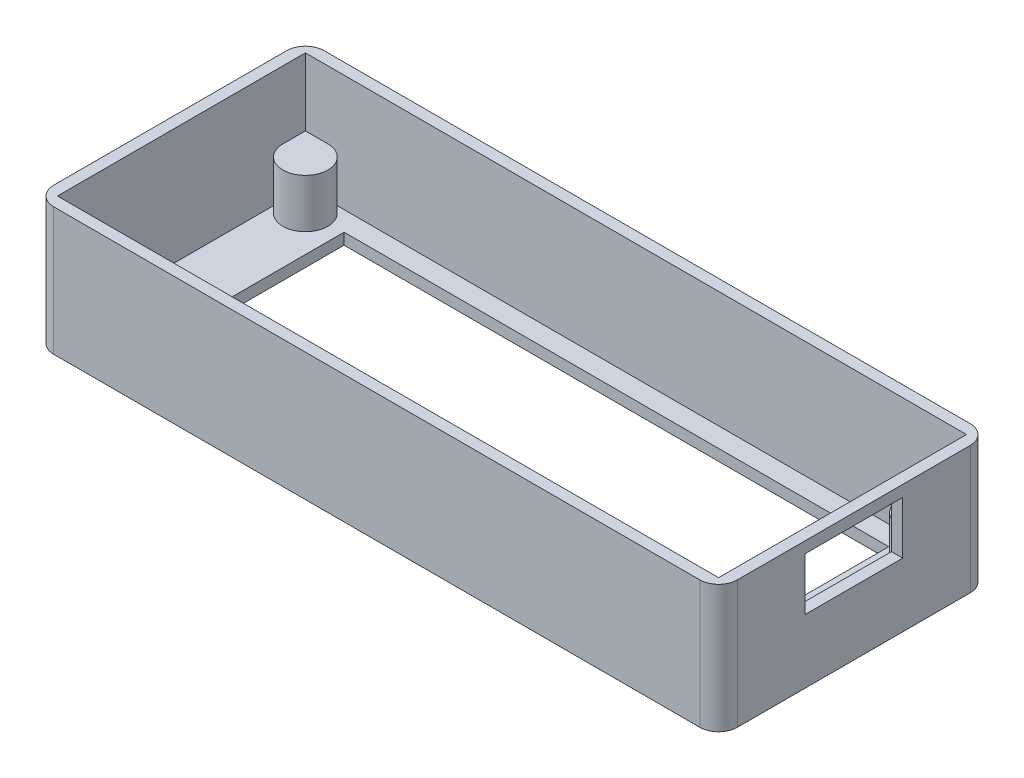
ISO-10303-21;
HEADER;
FILE_DESCRIPTION(('STEP AP214'),'2;1');
FILE_NAME('part.step','',(''),(''),'','','');
FILE_SCHEMA(('AUTOMOTIVE_DESIGN { 1 0 10303 214 1 1 1 1 }'));
ENDSEC;
DATA;
#1=APPLICATION_CONTEXT('core data for automotive mechanical design processes');
#2=APPLICATION_PROTOCOL_DEFINITION('international standard','automotive_design',2000,#1);
#3=PRODUCT_CONTEXT('',#1,'mechanical');
#4=PRODUCT('Part','Part','',(#3));
#5=PRODUCT_RELATED_PRODUCT_CATEGORY('part','',(#4));
#6=PRODUCT_DEFINITION_FORMATION('','',#4);
#7=PRODUCT_DEFINITION_CONTEXT('part definition',#1,'design');
#8=PRODUCT_DEFINITION('design','',#6,#7);
#9=PRODUCT_DEFINITION_SHAPE('','',#8);
#10=(LENGTH_UNIT() NAMED_UNIT(*) SI_UNIT(.MILLI.,.METRE.));
#11=(NAMED_UNIT(*) PLANE_ANGLE_UNIT() SI_UNIT($,.RADIAN.));
#12=(NAMED_UNIT(*) SI_UNIT($,.STERADIAN.) SOLID_ANGLE_UNIT());
#13=UNCERTAINTY_MEASURE_WITH_UNIT(LENGTH_MEASURE(1.E-05),#10,'distance_accuracy_value','');
#14=(GEOMETRIC_REPRESENTATION_CONTEXT(3) GLOBAL_UNCERTAINTY_ASSIGNED_CONTEXT((#13)) GLOBAL_UNIT_ASSIGNED_CONTEXT((#10,
#11,#12)) REPRESENTATION_CONTEXT('',''));
#15=CARTESIAN_POINT('',(0.,0.,0.));
#16=DIRECTION('',(0.,0.,1.));
#17=DIRECTION('',(1.,0.,0.));
#18=AXIS2_PLACEMENT_3D('',#15,#16,#17);
#19=CARTESIAN_POINT('',(-44.,17.,18.));
#20=DIRECTION('',(1.,0.,0.));
#21=DIRECTION('',(0.,0.,-1.));
#22=AXIS2_PLACEMENT_3D('',#19,#20,#21);
#23=PLANE('',#22);
#24=DIRECTION('',(0.,0.,-1.));
#25=VECTOR('',#24,1.);
#26=CARTESIAN_POINT('',(-44.,8.,16.5));
#27=LINE('',#26,#25);
#28=CARTESIAN_POINT('',(-44.,8.,16.5));
#29=VERTEX_POINT('',#28);
#30=CARTESIAN_POINT('',(-44.,8.,13.5));
#31=VERTEX_POINT('',#30);
#32=EDGE_CURVE('E257',#29,#31,#27,.T.);
#33=ORIENTED_EDGE('',*,*,#32,.T.);
#34=DIRECTION('',(0.,-1.,0.));
#35=VECTOR('',#34,1.);
#36=CARTESIAN_POINT('',(-44.,8.,13.5));
#37=LINE('',#36,#35);
#38=CARTESIAN_POINT('',(-44.,1.5,13.5));
#39=VERTEX_POINT('',#38);
#40=EDGE_CURVE('E264',#31,#39,#37,.T.);
#41=ORIENTED_EDGE('',*,*,#40,.T.);
#42=DIRECTION('',(0.,0.,1.));
#43=VECTOR('',#42,1.);
#44=CARTESIAN_POINT('',(-44.,1.5,0.));
#45=LINE('',#44,#43);
#46=CARTESIAN_POINT('',(-44.,1.5,-13.5));
#47=VERTEX_POINT('',#46);
#48=EDGE_CURVE('E366',#47,#39,#45,.T.);
#49=ORIENTED_EDGE('',*,*,#48,.F.);
#50=DIRECTION('',(0.,-1.,0.));
#51=VECTOR('',#50,1.);
#52=CARTESIAN_POINT('',(-44.,8.,-13.5));
#53=LINE('',#52,#51);
#54=CARTESIAN_POINT('',(-44.,8.,-13.5));
#55=VERTEX_POINT('',#54);
#56=EDGE_CURVE('E318',#55,#47,#53,.T.);
#57=ORIENTED_EDGE('',*,*,#56,.F.);
#58=DIRECTION('',(0.,0.,1.));
#59=VECTOR('',#58,1.);
#60=CARTESIAN_POINT('',(-44.,8.,-16.5));
#61=LINE('',#60,#59);
#62=CARTESIAN_POINT('',(-44.,8.,-16.5));
#63=VERTEX_POINT('',#62);
#64=EDGE_CURVE('E304',#63,#55,#61,.T.);
#65=ORIENTED_EDGE('',*,*,#64,.F.);
#66=DIRECTION('',(0.,-1.,0.));
#67=VECTOR('',#66,1.);
#68=CARTESIAN_POINT('',(-44.,17.,-16.5));
#69=LINE('',#68,#67);
#70=CARTESIAN_POINT('',(-44.,17.,-16.5));
#71=VERTEX_POINT('',#70);
#72=EDGE_CURVE('E360',#71,#63,#69,.T.);
#73=ORIENTED_EDGE('',*,*,#72,.F.);
#74=DIRECTION('',(0.,0.,1.));
#75=VECTOR('',#74,1.);
#76=CARTESIAN_POINT('',(-44.,17.,0.));
#77=LINE('',#76,#75);
#78=CARTESIAN_POINT('',(-44.,17.,16.5));
#79=VERTEX_POINT('',#78);
#80=EDGE_CURVE('E379',#71,#79,#77,.T.);
#81=ORIENTED_EDGE('',*,*,#80,.T.);
#82=DIRECTION('',(0.,-1.,0.));
#83=VECTOR('',#82,1.);
#84=CARTESIAN_POINT('',(-44.,17.,16.5));
#85=LINE('',#84,#83);
#86=EDGE_CURVE('E363',#79,#29,#85,.T.);
#87=ORIENTED_EDGE('',*,*,#86,.T.);
#88=EDGE_LOOP('',(#33,#41,#49,#57,#65,#73,#81,#87));
#89=FACE_BOUND('',#88,.T.);
#90=ADVANCED_FACE('F35',(#89),#23,.T.);
#91=CARTESIAN_POINT('',(44.,17.,18.));
#92=DIRECTION('',(-1.,0.,0.));
#93=DIRECTION('',(0.,0.,1.));
#94=AXIS2_PLACEMENT_3D('',#91,#92,#93);
#95=PLANE('',#94);
#96=DIRECTION('',(0.,-1.,0.));
#97=VECTOR('',#96,1.);
#98=CARTESIAN_POINT('',(44.,15.5,6.5));
#99=LINE('',#98,#97);
#100=CARTESIAN_POINT('',(44.,15.5,6.5));
#101=VERTEX_POINT('',#100);
#102=CARTESIAN_POINT('',(44.,8.5,6.5));
#103=VERTEX_POINT('',#102);
#104=EDGE_CURVE('E223',#101,#103,#99,.T.);
#105=ORIENTED_EDGE('',*,*,#104,.T.);
#106=DIRECTION('',(0.,0.,-1.));
#107=VECTOR('',#106,1.);
#108=CARTESIAN_POINT('',(44.,8.5,6.5));
#109=LINE('',#108,#107);
#110=CARTESIAN_POINT('',(44.,8.5,-6.5));
#111=VERTEX_POINT('',#110);
#112=EDGE_CURVE('E246',#103,#111,#109,.T.);
#113=ORIENTED_EDGE('',*,*,#112,.T.);
#114=DIRECTION('',(0.,1.,0.));
#115=VECTOR('',#114,1.);
#116=CARTESIAN_POINT('',(44.,15.5,-6.5));
#117=LINE('',#116,#115);
#118=CARTESIAN_POINT('',(44.,15.5,-6.5));
#119=VERTEX_POINT('',#118);
#120=EDGE_CURVE('E226',#111,#119,#117,.T.);
#121=ORIENTED_EDGE('',*,*,#120,.T.);
#122=DIRECTION('',(0.,0.,1.));
#123=VECTOR('',#122,1.);
#124=CARTESIAN_POINT('',(44.,15.5,6.5));
#125=LINE('',#124,#123);
#126=EDGE_CURVE('E227',#119,#101,#125,.T.);
#127=ORIENTED_EDGE('',*,*,#126,.T.);
#128=EDGE_LOOP('',(#105,#113,#121,#127));
#129=FACE_BOUND('',#128,.T.);
#130=DIRECTION('',(0.,0.,-1.));
#131=VECTOR('',#130,1.);
#132=CARTESIAN_POINT('',(44.,1.5,0.));
#133=LINE('',#132,#131);
#134=CARTESIAN_POINT('',(44.,1.5,13.5));
#135=VERTEX_POINT('',#134);
#136=CARTESIAN_POINT('',(44.,1.5,-13.5));
#137=VERTEX_POINT('',#136);
#138=EDGE_CURVE('E353',#135,#137,#133,.T.);
#139=ORIENTED_EDGE('',*,*,#138,.F.);
#140=DIRECTION('',(0.,-1.,0.));
#141=VECTOR('',#140,1.);
#142=CARTESIAN_POINT('',(44.,8.,13.5));
#143=LINE('',#142,#141);
#144=CARTESIAN_POINT('',(44.,8.,13.5));
#145=VERTEX_POINT('',#144);
#146=EDGE_CURVE('E285',#145,#135,#143,.T.);
#147=ORIENTED_EDGE('',*,*,#146,.F.);
#148=DIRECTION('',(0.,0.,-1.));
#149=VECTOR('',#148,1.);
#150=CARTESIAN_POINT('',(44.,8.,16.5));
#151=LINE('',#150,#149);
#152=CARTESIAN_POINT('',(44.,8.,16.5));
#153=VERTEX_POINT('',#152);
#154=EDGE_CURVE('E271',#153,#145,#151,.T.);
#155=ORIENTED_EDGE('',*,*,#154,.F.);
#156=DIRECTION('',(0.,-1.,0.));
#157=VECTOR('',#156,1.);
#158=CARTESIAN_POINT('',(44.,17.,16.5));
#159=LINE('',#158,#157);
#160=CARTESIAN_POINT('',(44.,17.,16.5));
#161=VERTEX_POINT('',#160);
#162=EDGE_CURVE('E361',#161,#153,#159,.T.);
#163=ORIENTED_EDGE('',*,*,#162,.F.);
#164=DIRECTION('',(0.,0.,-1.));
#165=VECTOR('',#164,1.);
#166=CARTESIAN_POINT('',(44.,17.,0.));
#167=LINE('',#166,#165);
#168=CARTESIAN_POINT('',(44.,17.,-16.5));
#169=VERTEX_POINT('',#168);
#170=EDGE_CURVE('E375',#161,#169,#167,.T.);
#171=ORIENTED_EDGE('',*,*,#170,.T.);
#172=DIRECTION('',(0.,-1.,0.));
#173=VECTOR('',#172,1.);
#174=CARTESIAN_POINT('',(44.,17.,-16.5));
#175=LINE('',#174,#173);
#176=CARTESIAN_POINT('',(44.,8.,-16.5));
#177=VERTEX_POINT('',#176);
#178=EDGE_CURVE('E356',#169,#177,#175,.T.);
#179=ORIENTED_EDGE('',*,*,#178,.T.);
#180=DIRECTION('',(0.,0.,1.));
#181=VECTOR('',#180,1.);
#182=CARTESIAN_POINT('',(44.,8.,-16.5));
#183=LINE('',#182,#181);
#184=CARTESIAN_POINT('',(44.,8.,-13.5));
#185=VERTEX_POINT('',#184);
#186=EDGE_CURVE('E289',#177,#185,#183,.T.);
#187=ORIENTED_EDGE('',*,*,#186,.T.);
#188=DIRECTION('',(0.,-1.,0.));
#189=VECTOR('',#188,1.);
#190=CARTESIAN_POINT('',(44.,8.,-13.5));
#191=LINE('',#190,#189);
#192=EDGE_CURVE('E296',#185,#137,#191,.T.);
#193=ORIENTED_EDGE('',*,*,#192,.T.);
#194=EDGE_LOOP('',(#139,#147,#155,#163,#171,#179,#187,#193));
#195=FACE_BOUND('',#194,.T.);
#196=ADVANCED_FACE('F482',(#129,#195),#95,.T.);
#197=CARTESIAN_POINT('',(0.,1.5,0.));
#198=DIRECTION('',(0.,-1.,0.));
#199=DIRECTION('',(0.,0.,-1.));
#200=AXIS2_PLACEMENT_3D('',#197,#198,#199);
#201=PLANE('',#200);
#202=DIRECTION('',(-1.,0.,0.));
#203=VECTOR('',#202,1.);
#204=CARTESIAN_POINT('',(-36.25,1.5,-13.9));
#205=LINE('',#204,#203);
#206=CARTESIAN_POINT('',(36.25,1.5,-13.9));
#207=VERTEX_POINT('',#206);
#208=CARTESIAN_POINT('',(-36.25,1.5,-13.9));
#209=VERTEX_POINT('',#208);
#210=EDGE_CURVE('E332',#207,#209,#205,.T.);
#211=ORIENTED_EDGE('',*,*,#210,.F.);
#212=DIRECTION('',(0.,0.,-1.));
#213=VECTOR('',#212,1.);
#214=CARTESIAN_POINT('',(36.25,1.5,13.9));
#215=LINE('',#214,#213);
#216=CARTESIAN_POINT('',(36.25,1.5,13.9));
#217=VERTEX_POINT('',#216);
#218=EDGE_CURVE('E330',#217,#207,#215,.T.);
#219=ORIENTED_EDGE('',*,*,#218,.F.);
#220=DIRECTION('',(1.,0.,0.));
#221=VECTOR('',#220,1.);
#222=CARTESIAN_POINT('',(-36.25,1.5,13.9));
#223=LINE('',#222,#221);
#224=CARTESIAN_POINT('',(-36.25,1.5,13.9));
#225=VERTEX_POINT('',#224);
#226=EDGE_CURVE('E338',#225,#217,#223,.T.);
#227=ORIENTED_EDGE('',*,*,#226,.F.);
#228=DIRECTION('',(0.,0.,1.));
#229=VECTOR('',#228,1.);
#230=CARTESIAN_POINT('',(-36.25,1.5,13.9));
#231=LINE('',#230,#229);
#232=EDGE_CURVE('E335',#209,#225,#231,.T.);
#233=ORIENTED_EDGE('',*,*,#232,.F.);
#234=EDGE_LOOP('',(#211,#219,#227,#233));
#235=FACE_BOUND('',#234,.T.);
#236=ORIENTED_EDGE('',*,*,#48,.T.);
#237=CARTESIAN_POINT('',(-41.,1.5,13.5));
#238=DIRECTION('',(0.,-1.,0.));
#239=DIRECTION('',(0.,0.,-1.));
#240=AXIS2_PLACEMENT_3D('',#237,#238,#239);
#241=CIRCLE('',#240,3.);
#242=CARTESIAN_POINT('',(-41.,1.5,16.5));
#243=VERTEX_POINT('',#242);
#244=EDGE_CURVE('E237',#39,#243,#241,.T.);
#245=ORIENTED_EDGE('',*,*,#244,.T.);
#246=DIRECTION('',(1.,0.,0.));
#247=VECTOR('',#246,1.);
#248=CARTESIAN_POINT('',(0.,1.5,16.5));
#249=LINE('',#248,#247);
#250=CARTESIAN_POINT('',(41.,1.5,16.5));
#251=VERTEX_POINT('',#250);
#252=EDGE_CURVE('E371',#243,#251,#249,.T.);
#253=ORIENTED_EDGE('',*,*,#252,.T.);
#254=CARTESIAN_POINT('',(41.,1.5,13.5));
#255=DIRECTION('',(0.,1.,0.));
#256=DIRECTION('',(0.,0.,-1.));
#257=AXIS2_PLACEMENT_3D('',#254,#255,#256);
#258=CIRCLE('',#257,3.);
#259=EDGE_CURVE('E270',#135,#251,#258,.T.);
#260=ORIENTED_EDGE('',*,*,#259,.F.);
#261=ORIENTED_EDGE('',*,*,#138,.T.);
#262=CARTESIAN_POINT('',(41.,1.5,-13.5));
#263=DIRECTION('',(0.,-1.,0.));
#264=DIRECTION('',(0.,0.,1.));
#265=AXIS2_PLACEMENT_3D('',#262,#263,#264);
#266=CIRCLE('',#265,3.);
#267=CARTESIAN_POINT('',(41.,1.5,-16.5));
#268=VERTEX_POINT('',#267);
#269=EDGE_CURVE('E288',#137,#268,#266,.T.);
#270=ORIENTED_EDGE('',*,*,#269,.T.);
#271=DIRECTION('',(-1.,0.,0.));
#272=VECTOR('',#271,1.);
#273=CARTESIAN_POINT('',(0.,1.5,-16.5));
#274=LINE('',#273,#272);
#275=CARTESIAN_POINT('',(-41.,1.5,-16.5));
#276=VERTEX_POINT('',#275);
#277=EDGE_CURVE('E355',#268,#276,#274,.T.);
#278=ORIENTED_EDGE('',*,*,#277,.T.);
#279=CARTESIAN_POINT('',(-41.,1.5,-13.5));
#280=DIRECTION('',(0.,1.,0.));
#281=DIRECTION('',(0.,0.,1.));
#282=AXIS2_PLACEMENT_3D('',#279,#280,#281);
#283=CIRCLE('',#282,3.);
#284=EDGE_CURVE('E303',#47,#276,#283,.T.);
#285=ORIENTED_EDGE('',*,*,#284,.F.);
#286=EDGE_LOOP('',(#236,#245,#253,#260,#261,#270,#278,#285));
#287=FACE_BOUND('',#286,.T.);
#288=ADVANCED_FACE('F488',(#235,#287),#201,.F.);
#289=CARTESIAN_POINT('',(0.,17.,0.));
#290=DIRECTION('',(0.,-1.,0.));
#291=DIRECTION('',(0.,0.,-1.));
#292=AXIS2_PLACEMENT_3D('',#289,#290,#291);
#293=PLANE('',#292);
#294=DIRECTION('',(0.,0.,1.));
#295=VECTOR('',#294,1.);
#296=CARTESIAN_POINT('',(-45.5,17.,18.));
#297=LINE('',#296,#295);
#298=CARTESIAN_POINT('',(-45.5,17.,-15.5));
#299=VERTEX_POINT('',#298);
#300=CARTESIAN_POINT('',(-45.5,17.,15.5));
#301=VERTEX_POINT('',#300);
#302=EDGE_CURVE('E390',#299,#301,#297,.T.);
#303=ORIENTED_EDGE('',*,*,#302,.T.);
#304=CARTESIAN_POINT('',(-43.,17.,15.5));
#305=DIRECTION('',(0.,-1.,0.));
#306=DIRECTION('',(0.,0.,-1.));
#307=AXIS2_PLACEMENT_3D('',#304,#305,#306);
#308=CIRCLE('',#307,2.5);
#309=CARTESIAN_POINT('',(-43.,17.,18.));
#310=VERTEX_POINT('',#309);
#311=EDGE_CURVE('E430',#301,#310,#308,.F.);
#312=ORIENTED_EDGE('',*,*,#311,.T.);
#313=DIRECTION('',(1.,0.,0.));
#314=VECTOR('',#313,1.);
#315=CARTESIAN_POINT('',(-45.5,17.,18.));
#316=LINE('',#315,#314);
#317=CARTESIAN_POINT('',(43.,17.,18.));
#318=VERTEX_POINT('',#317);
#319=EDGE_CURVE('E393',#310,#318,#316,.T.);
#320=ORIENTED_EDGE('',*,*,#319,.T.);
#321=CARTESIAN_POINT('',(43.,17.,15.5));
#322=DIRECTION('',(0.,-1.,0.));
#323=DIRECTION('',(0.,0.,-1.));
#324=AXIS2_PLACEMENT_3D('',#321,#322,#323);
#325=CIRCLE('',#324,2.5);
#326=CARTESIAN_POINT('',(45.5,17.,15.5));
#327=VERTEX_POINT('',#326);
#328=EDGE_CURVE('E426',#318,#327,#325,.F.);
#329=ORIENTED_EDGE('',*,*,#328,.T.);
#330=DIRECTION('',(0.,0.,-1.));
#331=VECTOR('',#330,1.);
#332=CARTESIAN_POINT('',(45.5,17.,18.));
#333=LINE('',#332,#331);
#334=CARTESIAN_POINT('',(45.5,17.,-15.5));
#335=VERTEX_POINT('',#334);
#336=EDGE_CURVE('E383',#327,#335,#333,.T.);
#337=ORIENTED_EDGE('',*,*,#336,.T.);
#338=CARTESIAN_POINT('',(43.,17.,-15.5));
#339=DIRECTION('',(0.,-1.,0.));
#340=DIRECTION('',(0.,0.,-1.));
#341=AXIS2_PLACEMENT_3D('',#338,#339,#340);
#342=CIRCLE('',#341,2.5);
#343=CARTESIAN_POINT('',(43.,17.,-18.));
#344=VERTEX_POINT('',#343);
#345=EDGE_CURVE('E424',#335,#344,#342,.F.);
#346=ORIENTED_EDGE('',*,*,#345,.T.);
#347=DIRECTION('',(-1.,0.,0.));
#348=VECTOR('',#347,1.);
#349=CARTESIAN_POINT('',(-45.5,17.,-18.));
#350=LINE('',#349,#348);
#351=CARTESIAN_POINT('',(-43.,17.,-18.));
#352=VERTEX_POINT('',#351);
#353=EDGE_CURVE('E386',#344,#352,#350,.T.);
#354=ORIENTED_EDGE('',*,*,#353,.T.);
#355=CARTESIAN_POINT('',(-43.,17.,-15.5));
#356=DIRECTION('',(0.,-1.,0.));
#357=DIRECTION('',(0.,0.,-1.));
#358=AXIS2_PLACEMENT_3D('',#355,#356,#357);
#359=CIRCLE('',#358,2.5);
#360=EDGE_CURVE('E428',#352,#299,#359,.F.);
#361=ORIENTED_EDGE('',*,*,#360,.T.);
#362=EDGE_LOOP('',(#303,#312,#320,#329,#337,#346,#354,#361));
#363=FACE_BOUND('',#362,.T.);
#364=ORIENTED_EDGE('',*,*,#170,.F.);
#365=DIRECTION('',(1.,0.,0.));
#366=VECTOR('',#365,1.);
#367=CARTESIAN_POINT('',(0.,17.,16.5));
#368=LINE('',#367,#366);
#369=EDGE_CURVE('E364',#79,#161,#368,.T.);
#370=ORIENTED_EDGE('',*,*,#369,.F.);
#371=ORIENTED_EDGE('',*,*,#80,.F.);
#372=DIRECTION('',(-1.,0.,0.));
#373=VECTOR('',#372,1.);
#374=CARTESIAN_POINT('',(0.,17.,-16.5));
#375=LINE('',#374,#373);
#376=EDGE_CURVE('E377',#169,#71,#375,.T.);
#377=ORIENTED_EDGE('',*,*,#376,.F.);
#378=EDGE_LOOP('',(#364,#370,#371,#377));
#379=FACE_BOUND('',#378,.T.);
#380=ADVANCED_FACE('F443',(#363,#379),#293,.F.);
#381=CARTESIAN_POINT('',(45.5,17.,18.));
#382=DIRECTION('',(-1.,0.,0.));
#383=DIRECTION('',(0.,0.,1.));
#384=AXIS2_PLACEMENT_3D('',#381,#382,#383);
#385=PLANE('',#384);
#386=DIRECTION('',(0.,0.,-1.));
#387=VECTOR('',#386,1.);
#388=CARTESIAN_POINT('',(45.5,8.5,6.5));
#389=LINE('',#388,#387);
#390=CARTESIAN_POINT('',(45.5,8.5,6.5));
#391=VERTEX_POINT('',#390);
#392=CARTESIAN_POINT('',(45.5,8.5,-6.5));
#393=VERTEX_POINT('',#392);
#394=EDGE_CURVE('E243',#391,#393,#389,.T.);
#395=ORIENTED_EDGE('',*,*,#394,.F.);
#396=DIRECTION('',(0.,-1.,0.));
#397=VECTOR('',#396,1.);
#398=CARTESIAN_POINT('',(45.5,15.5,6.5));
#399=LINE('',#398,#397);
#400=CARTESIAN_POINT('',(45.5,15.5,6.5));
#401=VERTEX_POINT('',#400);
#402=EDGE_CURVE('E58',#401,#391,#399,.T.);
#403=ORIENTED_EDGE('',*,*,#402,.F.);
#404=DIRECTION('',(0.,0.,1.));
#405=VECTOR('',#404,1.);
#406=CARTESIAN_POINT('',(45.5,15.5,6.5));
#407=LINE('',#406,#405);
#408=CARTESIAN_POINT('',(45.5,15.5,-6.5));
#409=VERTEX_POINT('',#408);
#410=EDGE_CURVE('E230',#409,#401,#407,.T.);
#411=ORIENTED_EDGE('',*,*,#410,.F.);
#412=DIRECTION('',(0.,1.,0.));
#413=VECTOR('',#412,1.);
#414=CARTESIAN_POINT('',(45.5,15.5,-6.5));
#415=LINE('',#414,#413);
#416=EDGE_CURVE('E238',#393,#409,#415,.T.);
#417=ORIENTED_EDGE('',*,*,#416,.F.);
#418=EDGE_LOOP('',(#395,#403,#411,#417));
#419=FACE_BOUND('',#418,.T.);
#420=ORIENTED_EDGE('',*,*,#336,.F.);
#421=DIRECTION('',(0.,-1.,0.));
#422=VECTOR('',#421,1.);
#423=CARTESIAN_POINT('',(45.5,17.,15.5));
#424=LINE('',#423,#422);
#425=CARTESIAN_POINT('',(45.5,0.,15.5));
#426=VERTEX_POINT('',#425);
#427=EDGE_CURVE('E11',#327,#426,#424,.T.);
#428=ORIENTED_EDGE('',*,*,#427,.T.);
#429=DIRECTION('',(0.,0.,-1.));
#430=VECTOR('',#429,1.);
#431=CARTESIAN_POINT('',(45.5,0.,18.));
#432=LINE('',#431,#430);
#433=CARTESIAN_POINT('',(45.5,0.,-15.5));
#434=VERTEX_POINT('',#433);
#435=EDGE_CURVE('E359',#426,#434,#432,.T.);
#436=ORIENTED_EDGE('',*,*,#435,.T.);
#437=DIRECTION('',(0.,-1.,0.));
#438=VECTOR('',#437,1.);
#439=CARTESIAN_POINT('',(45.5,17.,-15.5));
#440=LINE('',#439,#438);
#441=EDGE_CURVE('E43',#434,#335,#440,.F.);
#442=ORIENTED_EDGE('',*,*,#441,.T.);
#443=EDGE_LOOP('',(#420,#428,#436,#442));
#444=FACE_BOUND('',#443,.T.);
#445=ADVANCED_FACE('F241',(#419,#444),#385,.F.);
#446=CARTESIAN_POINT('',(-45.5,17.,-18.));
#447=DIRECTION('',(0.,0.,1.));
#448=DIRECTION('',(1.,0.,0.));
#449=AXIS2_PLACEMENT_3D('',#446,#447,#448);
#450=PLANE('',#449);
#451=DIRECTION('',(-1.,0.,0.));
#452=VECTOR('',#451,1.);
#453=CARTESIAN_POINT('',(-45.5,0.,-18.));
#454=LINE('',#453,#452);
#455=CARTESIAN_POINT('',(43.,0.,-18.));
#456=VERTEX_POINT('',#455);
#457=CARTESIAN_POINT('',(-43.,0.,-18.));
#458=VERTEX_POINT('',#457);
#459=EDGE_CURVE('E399',#456,#458,#454,.T.);
#460=ORIENTED_EDGE('',*,*,#459,.T.);
#461=DIRECTION('',(0.,-1.,0.));
#462=VECTOR('',#461,1.);
#463=CARTESIAN_POINT('',(-43.,17.,-18.));
#464=LINE('',#463,#462);
#465=EDGE_CURVE('E435',#458,#352,#464,.F.);
#466=ORIENTED_EDGE('',*,*,#465,.T.);
#467=ORIENTED_EDGE('',*,*,#353,.F.);
#468=DIRECTION('',(0.,-1.,0.));
#469=VECTOR('',#468,1.);
#470=CARTESIAN_POINT('',(43.,17.,-18.));
#471=LINE('',#470,#469);
#472=EDGE_CURVE('E432',#344,#456,#471,.T.);
#473=ORIENTED_EDGE('',*,*,#472,.T.);
#474=EDGE_LOOP('',(#460,#466,#467,#473));
#475=FACE_BOUND('',#474,.T.);
#476=ADVANCED_FACE('F450',(#475),#450,.F.);
#477=CARTESIAN_POINT('',(-45.5,17.,18.));
#478=DIRECTION('',(1.,0.,0.));
#479=DIRECTION('',(0.,0.,-1.));
#480=AXIS2_PLACEMENT_3D('',#477,#478,#479);
#481=PLANE('',#480);
#482=DIRECTION('',(0.,0.,1.));
#483=VECTOR('',#482,1.);
#484=CARTESIAN_POINT('',(-45.5,0.,18.));
#485=LINE('',#484,#483);
#486=CARTESIAN_POINT('',(-45.5,0.,-15.5));
#487=VERTEX_POINT('',#486);
#488=CARTESIAN_POINT('',(-45.5,0.,15.5));
#489=VERTEX_POINT('',#488);
#490=EDGE_CURVE('E402',#487,#489,#485,.T.);
#491=ORIENTED_EDGE('',*,*,#490,.T.);
#492=DIRECTION('',(0.,-1.,0.));
#493=VECTOR('',#492,1.);
#494=CARTESIAN_POINT('',(-45.5,17.,15.5));
#495=LINE('',#494,#493);
#496=EDGE_CURVE('E422',#489,#301,#495,.F.);
#497=ORIENTED_EDGE('',*,*,#496,.T.);
#498=ORIENTED_EDGE('',*,*,#302,.F.);
#499=DIRECTION('',(0.,-1.,0.));
#500=VECTOR('',#499,1.);
#501=CARTESIAN_POINT('',(-45.5,17.,-15.5));
#502=LINE('',#501,#500);
#503=EDGE_CURVE('E419',#299,#487,#502,.T.);
#504=ORIENTED_EDGE('',*,*,#503,.T.);
#505=EDGE_LOOP('',(#491,#497,#498,#504));
#506=FACE_BOUND('',#505,.T.);
#507=ADVANCED_FACE('F462',(#506),#481,.F.);
#508=CARTESIAN_POINT('',(-45.5,17.,18.));
#509=DIRECTION('',(0.,0.,-1.));
#510=DIRECTION('',(-1.,0.,0.));
#511=AXIS2_PLACEMENT_3D('',#508,#509,#510);
#512=PLANE('',#511);
#513=ORIENTED_EDGE('',*,*,#319,.F.);
#514=DIRECTION('',(0.,-1.,0.));
#515=VECTOR('',#514,1.);
#516=CARTESIAN_POINT('',(-43.,17.,18.));
#517=LINE('',#516,#515);
#518=CARTESIAN_POINT('',(-43.,0.,18.));
#519=VERTEX_POINT('',#518);
#520=EDGE_CURVE('E408',#310,#519,#517,.T.);
#521=ORIENTED_EDGE('',*,*,#520,.T.);
#522=DIRECTION('',(1.,0.,0.));
#523=VECTOR('',#522,1.);
#524=CARTESIAN_POINT('',(-45.5,0.,18.));
#525=LINE('',#524,#523);
#526=CARTESIAN_POINT('',(43.,0.,18.));
#527=VERTEX_POINT('',#526);
#528=EDGE_CURVE('E387',#519,#527,#525,.T.);
#529=ORIENTED_EDGE('',*,*,#528,.T.);
#530=DIRECTION('',(0.,-1.,0.));
#531=VECTOR('',#530,1.);
#532=CARTESIAN_POINT('',(43.,17.,18.));
#533=LINE('',#532,#531);
#534=EDGE_CURVE('E396',#527,#318,#533,.F.);
#535=ORIENTED_EDGE('',*,*,#534,.T.);
#536=EDGE_LOOP('',(#513,#521,#529,#535));
#537=FACE_BOUND('',#536,.T.);
#538=ADVANCED_FACE('F470',(#537),#512,.F.);
#539=CARTESIAN_POINT('',(0.,0.,0.));
#540=DIRECTION('',(0.,-1.,0.));
#541=DIRECTION('',(0.,0.,-1.));
#542=AXIS2_PLACEMENT_3D('',#539,#540,#541);
#543=PLANE('',#542);
#544=DIRECTION('',(0.,0.,-1.));
#545=VECTOR('',#544,1.);
#546=CARTESIAN_POINT('',(36.25,0.,13.9));
#547=LINE('',#546,#545);
#548=CARTESIAN_POINT('',(36.25,0.,13.9));
#549=VERTEX_POINT('',#548);
#550=CARTESIAN_POINT('',(36.25,0.,-13.9));
#551=VERTEX_POINT('',#550);
#552=EDGE_CURVE('E327',#549,#551,#547,.T.);
#553=ORIENTED_EDGE('',*,*,#552,.T.);
#554=DIRECTION('',(-1.,0.,0.));
#555=VECTOR('',#554,1.);
#556=CARTESIAN_POINT('',(-36.25,0.,-13.9));
#557=LINE('',#556,#555);
#558=CARTESIAN_POINT('',(-36.25,0.,-13.9));
#559=VERTEX_POINT('',#558);
#560=EDGE_CURVE('E344',#551,#559,#557,.T.);
#561=ORIENTED_EDGE('',*,*,#560,.T.);
#562=DIRECTION('',(0.,0.,1.));
#563=VECTOR('',#562,1.);
#564=CARTESIAN_POINT('',(-36.25,0.,13.9));
#565=LINE('',#564,#563);
#566=CARTESIAN_POINT('',(-36.25,0.,13.9));
#567=VERTEX_POINT('',#566);
#568=EDGE_CURVE('E321',#559,#567,#565,.T.);
#569=ORIENTED_EDGE('',*,*,#568,.T.);
#570=DIRECTION('',(1.,0.,0.));
#571=VECTOR('',#570,1.);
#572=CARTESIAN_POINT('',(-36.25,0.,13.9));
#573=LINE('',#572,#571);
#574=EDGE_CURVE('E324',#567,#549,#573,.T.);
#575=ORIENTED_EDGE('',*,*,#574,.T.);
#576=EDGE_LOOP('',(#553,#561,#569,#575));
#577=FACE_BOUND('',#576,.T.);
#578=ORIENTED_EDGE('',*,*,#528,.F.);
#579=CARTESIAN_POINT('',(-43.,0.,15.5));
#580=DIRECTION('',(0.,-1.,0.));
#581=DIRECTION('',(0.,0.,-1.));
#582=AXIS2_PLACEMENT_3D('',#579,#580,#581);
#583=CIRCLE('',#582,2.5);
#584=EDGE_CURVE('E417',#519,#489,#583,.T.);
#585=ORIENTED_EDGE('',*,*,#584,.T.);
#586=ORIENTED_EDGE('',*,*,#490,.F.);
#587=CARTESIAN_POINT('',(-43.,0.,-15.5));
#588=DIRECTION('',(0.,-1.,0.));
#589=DIRECTION('',(0.,0.,-1.));
#590=AXIS2_PLACEMENT_3D('',#587,#588,#589);
#591=CIRCLE('',#590,2.5);
#592=EDGE_CURVE('E415',#487,#458,#591,.T.);
#593=ORIENTED_EDGE('',*,*,#592,.T.);
#594=ORIENTED_EDGE('',*,*,#459,.F.);
#595=CARTESIAN_POINT('',(43.,0.,-15.5));
#596=DIRECTION('',(0.,-1.,0.));
#597=DIRECTION('',(0.,0.,-1.));
#598=AXIS2_PLACEMENT_3D('',#595,#596,#597);
#599=CIRCLE('',#598,2.5);
#600=EDGE_CURVE('E411',#456,#434,#599,.T.);
#601=ORIENTED_EDGE('',*,*,#600,.T.);
#602=ORIENTED_EDGE('',*,*,#435,.F.);
#603=CARTESIAN_POINT('',(43.,0.,15.5));
#604=DIRECTION('',(0.,-1.,0.));
#605=DIRECTION('',(0.,0.,-1.));
#606=AXIS2_PLACEMENT_3D('',#603,#604,#605);
#607=CIRCLE('',#606,2.5);
#608=EDGE_CURVE('E413',#426,#527,#607,.T.);
#609=ORIENTED_EDGE('',*,*,#608,.T.);
#610=EDGE_LOOP('',(#578,#585,#586,#593,#594,#601,#602,#609));
#611=FACE_BOUND('',#610,.T.);
#612=ADVANCED_FACE('F454',(#577,#611),#543,.T.);
#613=CARTESIAN_POINT('',(-45.5,17.,-16.5));
#614=DIRECTION('',(0.,0.,1.));
#615=DIRECTION('',(1.,0.,0.));
#616=AXIS2_PLACEMENT_3D('',#613,#614,#615);
#617=PLANE('',#616);
#618=DIRECTION('',(0.,-1.,0.));
#619=VECTOR('',#618,1.);
#620=CARTESIAN_POINT('',(41.,8.,-16.5));
#621=LINE('',#620,#619);
#622=CARTESIAN_POINT('',(41.,8.,-16.5));
#623=VERTEX_POINT('',#622);
#624=EDGE_CURVE('E300',#623,#268,#621,.T.);
#625=ORIENTED_EDGE('',*,*,#624,.F.);
#626=DIRECTION('',(1.,0.,0.));
#627=VECTOR('',#626,1.);
#628=CARTESIAN_POINT('',(44.,8.,-16.5));
#629=LINE('',#628,#627);
#630=EDGE_CURVE('E291',#623,#177,#629,.T.);
#631=ORIENTED_EDGE('',*,*,#630,.T.);
#632=ORIENTED_EDGE('',*,*,#178,.F.);
#633=ORIENTED_EDGE('',*,*,#376,.T.);
#634=ORIENTED_EDGE('',*,*,#72,.T.);
#635=DIRECTION('',(-1.,0.,0.));
#636=VECTOR('',#635,1.);
#637=CARTESIAN_POINT('',(-44.,8.,-16.5));
#638=LINE('',#637,#636);
#639=CARTESIAN_POINT('',(-41.,8.,-16.5));
#640=VERTEX_POINT('',#639);
#641=EDGE_CURVE('E310',#640,#63,#638,.T.);
#642=ORIENTED_EDGE('',*,*,#641,.F.);
#643=DIRECTION('',(0.,-1.,0.));
#644=VECTOR('',#643,1.);
#645=CARTESIAN_POINT('',(-41.,8.,-16.5));
#646=LINE('',#645,#644);
#647=EDGE_CURVE('E313',#640,#276,#646,.T.);
#648=ORIENTED_EDGE('',*,*,#647,.T.);
#649=ORIENTED_EDGE('',*,*,#277,.F.);
#650=EDGE_LOOP('',(#625,#631,#632,#633,#634,#642,#648,#649));
#651=FACE_BOUND('',#650,.T.);
#652=ADVANCED_FACE('F493',(#651),#617,.T.);
#653=CARTESIAN_POINT('',(-45.5,17.,16.5));
#654=DIRECTION('',(0.,0.,-1.));
#655=DIRECTION('',(-1.,0.,0.));
#656=AXIS2_PLACEMENT_3D('',#653,#654,#655);
#657=PLANE('',#656);
#658=DIRECTION('',(0.,-1.,0.));
#659=VECTOR('',#658,1.);
#660=CARTESIAN_POINT('',(-41.,8.,16.5));
#661=LINE('',#660,#659);
#662=CARTESIAN_POINT('',(-41.,8.,16.5));
#663=VERTEX_POINT('',#662);
#664=EDGE_CURVE('E267',#663,#243,#661,.T.);
#665=ORIENTED_EDGE('',*,*,#664,.F.);
#666=DIRECTION('',(-1.,0.,0.));
#667=VECTOR('',#666,1.);
#668=CARTESIAN_POINT('',(-44.,8.,16.5));
#669=LINE('',#668,#667);
#670=EDGE_CURVE('E259',#663,#29,#669,.T.);
#671=ORIENTED_EDGE('',*,*,#670,.T.);
#672=ORIENTED_EDGE('',*,*,#86,.F.);
#673=ORIENTED_EDGE('',*,*,#369,.T.);
#674=ORIENTED_EDGE('',*,*,#162,.T.);
#675=DIRECTION('',(1.,0.,0.));
#676=VECTOR('',#675,1.);
#677=CARTESIAN_POINT('',(44.,8.,16.5));
#678=LINE('',#677,#676);
#679=CARTESIAN_POINT('',(41.,8.,16.5));
#680=VERTEX_POINT('',#679);
#681=EDGE_CURVE('E277',#680,#153,#678,.T.);
#682=ORIENTED_EDGE('',*,*,#681,.F.);
#683=DIRECTION('',(0.,-1.,0.));
#684=VECTOR('',#683,1.);
#685=CARTESIAN_POINT('',(41.,8.,16.5));
#686=LINE('',#685,#684);
#687=EDGE_CURVE('E280',#680,#251,#686,.T.);
#688=ORIENTED_EDGE('',*,*,#687,.T.);
#689=ORIENTED_EDGE('',*,*,#252,.F.);
#690=EDGE_LOOP('',(#665,#671,#672,#673,#674,#682,#688,#689));
#691=FACE_BOUND('',#690,.T.);
#692=ADVANCED_FACE('F494',(#691),#657,.T.);
#693=CARTESIAN_POINT('',(-43.,17.,15.5));
#694=DIRECTION('',(0.,-1.,0.));
#695=DIRECTION('',(0.,0.,-1.));
#696=AXIS2_PLACEMENT_3D('',#693,#694,#695);
#697=CYLINDRICAL_SURFACE('',#696,2.5);
#698=ORIENTED_EDGE('',*,*,#311,.F.);
#699=ORIENTED_EDGE('',*,*,#496,.F.);
#700=ORIENTED_EDGE('',*,*,#584,.F.);
#701=ORIENTED_EDGE('',*,*,#520,.F.);
#702=EDGE_LOOP('',(#698,#699,#700,#701));
#703=FACE_BOUND('',#702,.T.);
#704=ADVANCED_FACE('F468',(#703),#697,.T.);
#705=CARTESIAN_POINT('',(-43.,17.,-15.5));
#706=DIRECTION('',(0.,-1.,0.));
#707=DIRECTION('',(0.,0.,-1.));
#708=AXIS2_PLACEMENT_3D('',#705,#706,#707);
#709=CYLINDRICAL_SURFACE('',#708,2.5);
#710=ORIENTED_EDGE('',*,*,#360,.F.);
#711=ORIENTED_EDGE('',*,*,#465,.F.);
#712=ORIENTED_EDGE('',*,*,#592,.F.);
#713=ORIENTED_EDGE('',*,*,#503,.F.);
#714=EDGE_LOOP('',(#710,#711,#712,#713));
#715=FACE_BOUND('',#714,.T.);
#716=ADVANCED_FACE('F459',(#715),#709,.T.);
#717=CARTESIAN_POINT('',(43.,17.,15.5));
#718=DIRECTION('',(0.,-1.,0.));
#719=DIRECTION('',(0.,0.,-1.));
#720=AXIS2_PLACEMENT_3D('',#717,#718,#719);
#721=CYLINDRICAL_SURFACE('',#720,2.5);
#722=ORIENTED_EDGE('',*,*,#328,.F.);
#723=ORIENTED_EDGE('',*,*,#534,.F.);
#724=ORIENTED_EDGE('',*,*,#608,.F.);
#725=ORIENTED_EDGE('',*,*,#427,.F.);
#726=EDGE_LOOP('',(#722,#723,#724,#725));
#727=FACE_BOUND('',#726,.T.);
#728=ADVANCED_FACE('F473',(#727),#721,.T.);
#729=CARTESIAN_POINT('',(43.,17.,-15.5));
#730=DIRECTION('',(0.,-1.,0.));
#731=DIRECTION('',(0.,0.,-1.));
#732=AXIS2_PLACEMENT_3D('',#729,#730,#731);
#733=CYLINDRICAL_SURFACE('',#732,2.5);
#734=ORIENTED_EDGE('',*,*,#345,.F.);
#735=ORIENTED_EDGE('',*,*,#441,.F.);
#736=ORIENTED_EDGE('',*,*,#600,.F.);
#737=ORIENTED_EDGE('',*,*,#472,.F.);
#738=EDGE_LOOP('',(#734,#735,#736,#737));
#739=FACE_BOUND('',#738,.T.);
#740=ADVANCED_FACE('F37',(#739),#733,.T.);
#741=CARTESIAN_POINT('',(36.25,-0.000999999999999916,13.9));
#742=DIRECTION('',(1.,0.,0.));
#743=DIRECTION('',(0.,0.,-1.));
#744=AXIS2_PLACEMENT_3D('',#741,#742,#743);
#745=PLANE('',#744);
#746=DIRECTION('',(0.,1.,0.));
#747=VECTOR('',#746,1.);
#748=CARTESIAN_POINT('',(36.25,-0.000999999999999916,13.9));
#749=LINE('',#748,#747);
#750=EDGE_CURVE('E342',#549,#217,#749,.T.);
#751=ORIENTED_EDGE('',*,*,#750,.T.);
#752=ORIENTED_EDGE('',*,*,#218,.T.);
#753=DIRECTION('',(0.,1.,0.));
#754=VECTOR('',#753,1.);
#755=CARTESIAN_POINT('',(36.25,-0.000999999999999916,-13.9));
#756=LINE('',#755,#754);
#757=EDGE_CURVE('E341',#551,#207,#756,.T.);
#758=ORIENTED_EDGE('',*,*,#757,.F.);
#759=ORIENTED_EDGE('',*,*,#552,.F.);
#760=EDGE_LOOP('',(#751,#752,#758,#759));
#761=FACE_BOUND('',#760,.T.);
#762=ADVANCED_FACE('F479',(#761),#745,.F.);
#763=CARTESIAN_POINT('',(-36.25,-0.000999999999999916,13.9));
#764=DIRECTION('',(0.,0.,1.));
#765=DIRECTION('',(1.,0.,0.));
#766=AXIS2_PLACEMENT_3D('',#763,#764,#765);
#767=PLANE('',#766);
#768=DIRECTION('',(0.,1.,0.));
#769=VECTOR('',#768,1.);
#770=CARTESIAN_POINT('',(-36.25,-0.000999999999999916,13.9));
#771=LINE('',#770,#769);
#772=EDGE_CURVE('E345',#567,#225,#771,.T.);
#773=ORIENTED_EDGE('',*,*,#772,.T.);
#774=ORIENTED_EDGE('',*,*,#226,.T.);
#775=ORIENTED_EDGE('',*,*,#750,.F.);
#776=ORIENTED_EDGE('',*,*,#574,.F.);
#777=EDGE_LOOP('',(#773,#774,#775,#776));
#778=FACE_BOUND('',#777,.T.);
#779=ADVANCED_FACE('F552',(#778),#767,.F.);
#780=CARTESIAN_POINT('',(-36.25,-0.000999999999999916,13.9));
#781=DIRECTION('',(-1.,0.,0.));
#782=DIRECTION('',(0.,0.,1.));
#783=AXIS2_PLACEMENT_3D('',#780,#781,#782);
#784=PLANE('',#783);
#785=DIRECTION('',(0.,1.,0.));
#786=VECTOR('',#785,1.);
#787=CARTESIAN_POINT('',(-36.25,-0.000999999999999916,-13.9));
#788=LINE('',#787,#786);
#789=EDGE_CURVE('E347',#559,#209,#788,.T.);
#790=ORIENTED_EDGE('',*,*,#789,.T.);
#791=ORIENTED_EDGE('',*,*,#232,.T.);
#792=ORIENTED_EDGE('',*,*,#772,.F.);
#793=ORIENTED_EDGE('',*,*,#568,.F.);
#794=EDGE_LOOP('',(#790,#791,#792,#793));
#795=FACE_BOUND('',#794,.T.);
#796=ADVANCED_FACE('F562',(#795),#784,.F.);
#797=CARTESIAN_POINT('',(-36.25,-0.000999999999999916,-13.9));
#798=DIRECTION('',(0.,0.,-1.));
#799=DIRECTION('',(-1.,0.,0.));
#800=AXIS2_PLACEMENT_3D('',#797,#798,#799);
#801=PLANE('',#800);
#802=ORIENTED_EDGE('',*,*,#757,.T.);
#803=ORIENTED_EDGE('',*,*,#210,.T.);
#804=ORIENTED_EDGE('',*,*,#789,.F.);
#805=ORIENTED_EDGE('',*,*,#560,.F.);
#806=EDGE_LOOP('',(#802,#803,#804,#805));
#807=FACE_BOUND('',#806,.T.);
#808=ADVANCED_FACE('F572',(#807),#801,.F.);
#809=CARTESIAN_POINT('',(-41.,8.,-13.5));
#810=DIRECTION('',(0.,-1.,0.));
#811=DIRECTION('',(0.,0.,-1.));
#812=AXIS2_PLACEMENT_3D('',#809,#810,#811);
#813=CYLINDRICAL_SURFACE('',#812,3.);
#814=ORIENTED_EDGE('',*,*,#284,.T.);
#815=ORIENTED_EDGE('',*,*,#647,.F.);
#816=CARTESIAN_POINT('',(-41.,8.,-13.5));
#817=DIRECTION('',(0.,1.,0.));
#818=DIRECTION('',(0.,0.,1.));
#819=AXIS2_PLACEMENT_3D('',#816,#817,#818);
#820=CIRCLE('',#819,3.);
#821=EDGE_CURVE('E307',#55,#640,#820,.T.);
#822=ORIENTED_EDGE('',*,*,#821,.F.);
#823=ORIENTED_EDGE('',*,*,#56,.T.);
#824=EDGE_LOOP('',(#814,#815,#822,#823));
#825=FACE_BOUND('',#824,.T.);
#826=ADVANCED_FACE('F582',(#825),#813,.T.);
#827=CARTESIAN_POINT('',(-41.,8.,-13.5));
#828=DIRECTION('',(0.,1.,0.));
#829=DIRECTION('',(0.,0.,1.));
#830=AXIS2_PLACEMENT_3D('',#827,#828,#829);
#831=PLANE('',#830);
#832=ORIENTED_EDGE('',*,*,#64,.T.);
#833=ORIENTED_EDGE('',*,*,#821,.T.);
#834=ORIENTED_EDGE('',*,*,#641,.T.);
#835=EDGE_LOOP('',(#832,#833,#834));
#836=FACE_BOUND('',#835,.T.);
#837=ADVANCED_FACE('F592',(#836),#831,.T.);
#838=CARTESIAN_POINT('',(41.,8.,-13.5));
#839=DIRECTION('',(0.,-1.,0.));
#840=DIRECTION('',(0.,0.,-1.));
#841=AXIS2_PLACEMENT_3D('',#838,#839,#840);
#842=CYLINDRICAL_SURFACE('',#841,3.);
#843=ORIENTED_EDGE('',*,*,#269,.F.);
#844=ORIENTED_EDGE('',*,*,#192,.F.);
#845=CARTESIAN_POINT('',(41.,8.,-13.5));
#846=DIRECTION('',(0.,-1.,0.));
#847=DIRECTION('',(0.,0.,1.));
#848=AXIS2_PLACEMENT_3D('',#845,#846,#847);
#849=CIRCLE('',#848,3.);
#850=EDGE_CURVE('E293',#185,#623,#849,.T.);
#851=ORIENTED_EDGE('',*,*,#850,.T.);
#852=ORIENTED_EDGE('',*,*,#624,.T.);
#853=EDGE_LOOP('',(#843,#844,#851,#852));
#854=FACE_BOUND('',#853,.T.);
#855=ADVANCED_FACE('F602',(#854),#842,.T.);
#856=CARTESIAN_POINT('',(41.,8.,-13.5));
#857=DIRECTION('',(0.,1.,0.));
#858=DIRECTION('',(0.,0.,1.));
#859=AXIS2_PLACEMENT_3D('',#856,#857,#858);
#860=PLANE('',#859);
#861=ORIENTED_EDGE('',*,*,#186,.F.);
#862=ORIENTED_EDGE('',*,*,#630,.F.);
#863=ORIENTED_EDGE('',*,*,#850,.F.);
#864=EDGE_LOOP('',(#861,#862,#863));
#865=FACE_BOUND('',#864,.T.);
#866=ADVANCED_FACE('F620',(#865),#860,.T.);
#867=CARTESIAN_POINT('',(41.,8.,13.5));
#868=DIRECTION('',(0.,-1.,0.));
#869=DIRECTION('',(0.,0.,-1.));
#870=AXIS2_PLACEMENT_3D('',#867,#868,#869);
#871=CYLINDRICAL_SURFACE('',#870,3.);
#872=ORIENTED_EDGE('',*,*,#259,.T.);
#873=ORIENTED_EDGE('',*,*,#687,.F.);
#874=CARTESIAN_POINT('',(41.,8.,13.5));
#875=DIRECTION('',(0.,1.,0.));
#876=DIRECTION('',(0.,0.,-1.));
#877=AXIS2_PLACEMENT_3D('',#874,#875,#876);
#878=CIRCLE('',#877,3.);
#879=EDGE_CURVE('E274',#145,#680,#878,.T.);
#880=ORIENTED_EDGE('',*,*,#879,.F.);
#881=ORIENTED_EDGE('',*,*,#146,.T.);
#882=EDGE_LOOP('',(#872,#873,#880,#881));
#883=FACE_BOUND('',#882,.T.);
#884=ADVANCED_FACE('F629',(#883),#871,.T.);
#885=CARTESIAN_POINT('',(41.,8.,13.5));
#886=DIRECTION('',(0.,1.,0.));
#887=DIRECTION('',(0.,0.,-1.));
#888=AXIS2_PLACEMENT_3D('',#885,#886,#887);
#889=PLANE('',#888);
#890=ORIENTED_EDGE('',*,*,#154,.T.);
#891=ORIENTED_EDGE('',*,*,#879,.T.);
#892=ORIENTED_EDGE('',*,*,#681,.T.);
#893=EDGE_LOOP('',(#890,#891,#892));
#894=FACE_BOUND('',#893,.T.);
#895=ADVANCED_FACE('F654',(#894),#889,.T.);
#896=CARTESIAN_POINT('',(-41.,8.,13.5));
#897=DIRECTION('',(0.,-1.,0.));
#898=DIRECTION('',(0.,0.,-1.));
#899=AXIS2_PLACEMENT_3D('',#896,#897,#898);
#900=CYLINDRICAL_SURFACE('',#899,3.);
#901=ORIENTED_EDGE('',*,*,#244,.F.);
#902=ORIENTED_EDGE('',*,*,#40,.F.);
#903=CARTESIAN_POINT('',(-41.,8.,13.5));
#904=DIRECTION('',(0.,-1.,0.));
#905=DIRECTION('',(0.,0.,-1.));
#906=AXIS2_PLACEMENT_3D('',#903,#904,#905);
#907=CIRCLE('',#906,3.);
#908=EDGE_CURVE('E261',#31,#663,#907,.T.);
#909=ORIENTED_EDGE('',*,*,#908,.T.);
#910=ORIENTED_EDGE('',*,*,#664,.T.);
#911=EDGE_LOOP('',(#901,#902,#909,#910));
#912=FACE_BOUND('',#911,.T.);
#913=ADVANCED_FACE('F664',(#912),#900,.T.);
#914=CARTESIAN_POINT('',(-41.,8.,13.5));
#915=DIRECTION('',(0.,1.,0.));
#916=DIRECTION('',(0.,0.,-1.));
#917=AXIS2_PLACEMENT_3D('',#914,#915,#916);
#918=PLANE('',#917);
#919=ORIENTED_EDGE('',*,*,#32,.F.);
#920=ORIENTED_EDGE('',*,*,#670,.F.);
#921=ORIENTED_EDGE('',*,*,#908,.F.);
#922=EDGE_LOOP('',(#919,#920,#921));
#923=FACE_BOUND('',#922,.T.);
#924=ADVANCED_FACE('F674',(#923),#918,.T.);
#925=CARTESIAN_POINT('',(-45.501,15.5,6.5));
#926=DIRECTION('',(0.,0.,1.));
#927=DIRECTION('',(1.,0.,0.));
#928=AXIS2_PLACEMENT_3D('',#925,#926,#927);
#929=PLANE('',#928);
#930=DIRECTION('',(1.,0.,0.));
#931=VECTOR('',#930,1.);
#932=CARTESIAN_POINT('',(-45.501,15.5,6.5));
#933=LINE('',#932,#931);
#934=EDGE_CURVE('E219',#101,#401,#933,.T.);
#935=ORIENTED_EDGE('',*,*,#934,.T.);
#936=ORIENTED_EDGE('',*,*,#402,.T.);
#937=DIRECTION('',(1.,0.,0.));
#938=VECTOR('',#937,1.);
#939=CARTESIAN_POINT('',(-45.501,8.5,6.5));
#940=LINE('',#939,#938);
#941=EDGE_CURVE('E251',#103,#391,#940,.T.);
#942=ORIENTED_EDGE('',*,*,#941,.F.);
#943=ORIENTED_EDGE('',*,*,#104,.F.);
#944=EDGE_LOOP('',(#935,#936,#942,#943));
#945=FACE_BOUND('',#944,.T.);
#946=ADVANCED_FACE('F221',(#945),#929,.F.);
#947=CARTESIAN_POINT('',(-45.501,15.5,6.5));
#948=DIRECTION('',(0.,1.,0.));
#949=DIRECTION('',(0.,0.,1.));
#950=AXIS2_PLACEMENT_3D('',#947,#948,#949);
#951=PLANE('',#950);
#952=DIRECTION('',(1.,0.,0.));
#953=VECTOR('',#952,1.);
#954=CARTESIAN_POINT('',(-45.501,15.5,-6.5));
#955=LINE('',#954,#953);
#956=EDGE_CURVE('E233',#119,#409,#955,.T.);
#957=ORIENTED_EDGE('',*,*,#956,.T.);
#958=ORIENTED_EDGE('',*,*,#410,.T.);
#959=ORIENTED_EDGE('',*,*,#934,.F.);
#960=ORIENTED_EDGE('',*,*,#126,.F.);
#961=EDGE_LOOP('',(#957,#958,#959,#960));
#962=FACE_BOUND('',#961,.T.);
#963=ADVANCED_FACE('F231',(#962),#951,.F.);
#964=CARTESIAN_POINT('',(-45.501,15.5,-6.5));
#965=DIRECTION('',(0.,0.,-1.));
#966=DIRECTION('',(0.,1.,0.));
#967=AXIS2_PLACEMENT_3D('',#964,#965,#966);
#968=PLANE('',#967);
#969=DIRECTION('',(1.,0.,0.));
#970=VECTOR('',#969,1.);
#971=CARTESIAN_POINT('',(-45.501,8.5,-6.5));
#972=LINE('',#971,#970);
#973=EDGE_CURVE('E50',#111,#393,#972,.T.);
#974=ORIENTED_EDGE('',*,*,#973,.T.);
#975=ORIENTED_EDGE('',*,*,#416,.T.);
#976=ORIENTED_EDGE('',*,*,#956,.F.);
#977=ORIENTED_EDGE('',*,*,#120,.F.);
#978=EDGE_LOOP('',(#974,#975,#976,#977));
#979=FACE_BOUND('',#978,.T.);
#980=ADVANCED_FACE('F713',(#979),#968,.F.);
#981=CARTESIAN_POINT('',(-45.501,8.5,6.5));
#982=DIRECTION('',(0.,-1.,0.));
#983=DIRECTION('',(0.,0.,-1.));
#984=AXIS2_PLACEMENT_3D('',#981,#982,#983);
#985=PLANE('',#984);
#986=ORIENTED_EDGE('',*,*,#941,.T.);
#987=ORIENTED_EDGE('',*,*,#394,.T.);
#988=ORIENTED_EDGE('',*,*,#973,.F.);
#989=ORIENTED_EDGE('',*,*,#112,.F.);
#990=EDGE_LOOP('',(#986,#987,#988,#989));
#991=FACE_BOUND('',#990,.T.);
#992=ADVANCED_FACE('F722',(#991),#985,.F.);
#993=CLOSED_SHELL('',(#90,#196,#288,#380,#445,#476,#507,#538,#612,#652,#692,#704,#716,#728,#740,
#762,#779,#796,#808,#826,#837,#855,#866,#884,#895,#913,#924,#946,#963,#980,#992));
#994=MANIFOLD_SOLID_BREP('B2',#993);
#995=ADVANCED_BREP_SHAPE_REPRESENTATION('',(#18,#994),#14);
#996=SHAPE_DEFINITION_REPRESENTATION(#9,#995);
ENDSEC;
END-ISO-10303-21;
